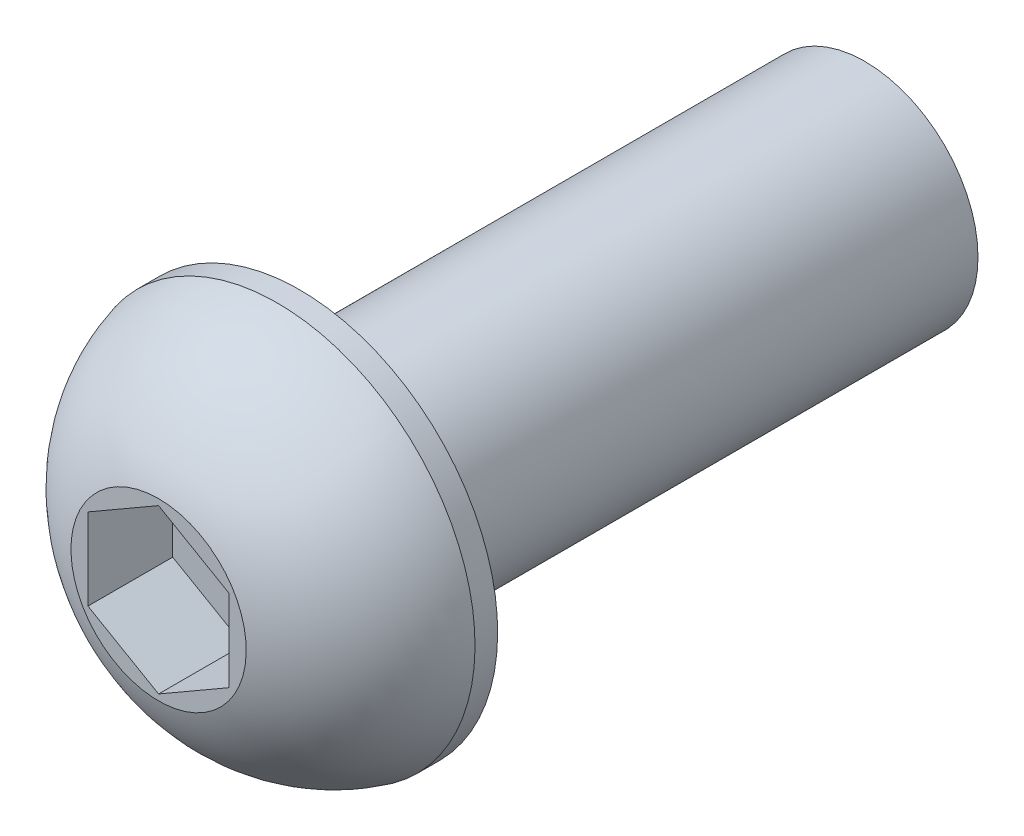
ISO-10303-21;
HEADER;
FILE_DESCRIPTION(('STEP AP214'),'2;1');
FILE_NAME('part.step','',(''),(''),'','','');
FILE_SCHEMA(('AUTOMOTIVE_DESIGN { 1 0 10303 214 1 1 1 1 }'));
ENDSEC;
DATA;
#1=APPLICATION_CONTEXT('core data for automotive mechanical design processes');
#2=APPLICATION_PROTOCOL_DEFINITION('international standard','automotive_design',2000,#1);
#3=PRODUCT_CONTEXT('',#1,'mechanical');
#4=PRODUCT('Part','Part','',(#3));
#5=PRODUCT_RELATED_PRODUCT_CATEGORY('part','',(#4));
#6=PRODUCT_DEFINITION_FORMATION('','',#4);
#7=PRODUCT_DEFINITION_CONTEXT('part definition',#1,'design');
#8=PRODUCT_DEFINITION('design','',#6,#7);
#9=PRODUCT_DEFINITION_SHAPE('','',#8);
#10=(LENGTH_UNIT() NAMED_UNIT(*) SI_UNIT(.MILLI.,.METRE.));
#11=(NAMED_UNIT(*) PLANE_ANGLE_UNIT() SI_UNIT($,.RADIAN.));
#12=(NAMED_UNIT(*) SI_UNIT($,.STERADIAN.) SOLID_ANGLE_UNIT());
#13=UNCERTAINTY_MEASURE_WITH_UNIT(LENGTH_MEASURE(1.E-05),#10,'distance_accuracy_value','');
#14=(GEOMETRIC_REPRESENTATION_CONTEXT(3) GLOBAL_UNCERTAINTY_ASSIGNED_CONTEXT((#13)) GLOBAL_UNIT_ASSIGNED_CONTEXT((#10,
#11,#12)) REPRESENTATION_CONTEXT('',''));
#15=CARTESIAN_POINT('',(0.,0.,0.));
#16=DIRECTION('',(0.,0.,1.));
#17=DIRECTION('',(1.,0.,0.));
#18=AXIS2_PLACEMENT_3D('',#15,#16,#17);
#19=CARTESIAN_POINT('',(0.,0.,5.));
#20=DIRECTION('',(0.,0.,1.));
#21=DIRECTION('',(0.86602540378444,-0.5,0.));
#22=AXIS2_PLACEMENT_3D('',#19,#20,#21);
#23=PLANE('',#22);
#24=CARTESIAN_POINT('',(0.,0.,5.));
#25=DIRECTION('',(0.,0.,1.));
#26=DIRECTION('',(0.86602540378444,-0.5,0.));
#27=AXIS2_PLACEMENT_3D('',#24,#25,#26);
#28=CIRCLE('',#27,3.10124400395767);
#29=CARTESIAN_POINT('',(2.68575609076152,-1.55062200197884,5.));
#30=VERTEX_POINT('',#29);
#31=EDGE_CURVE('E124',#30,#30,#28,.T.);
#32=ORIENTED_EDGE('',*,*,#31,.T.);
#33=EDGE_LOOP('',(#32));
#34=FACE_BOUND('',#33,.T.);
#35=DIRECTION('',(0.86602540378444,-0.5,0.));
#36=VECTOR('',#35,1.);
#37=CARTESIAN_POINT('',(0.,2.88675134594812,5.));
#38=LINE('',#37,#36);
#39=CARTESIAN_POINT('',(0.,2.88675134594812,5.));
#40=VERTEX_POINT('',#39);
#41=CARTESIAN_POINT('',(2.5,1.44337567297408,5.));
#42=VERTEX_POINT('',#41);
#43=EDGE_CURVE('E85',#40,#42,#38,.T.);
#44=ORIENTED_EDGE('',*,*,#43,.T.);
#45=DIRECTION('',(0.,-1.,0.));
#46=VECTOR('',#45,1.);
#47=CARTESIAN_POINT('',(2.5,1.44337567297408,5.));
#48=LINE('',#47,#46);
#49=CARTESIAN_POINT('',(2.5,-1.44337567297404,5.));
#50=VERTEX_POINT('',#49);
#51=EDGE_CURVE('E30',#42,#50,#48,.T.);
#52=ORIENTED_EDGE('',*,*,#51,.T.);
#53=DIRECTION('',(0.866025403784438,0.5,0.));
#54=VECTOR('',#53,1.);
#55=CARTESIAN_POINT('',(0.,-2.88675134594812,5.));
#56=LINE('',#55,#54);
#57=CARTESIAN_POINT('',(0.,-2.88675134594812,5.));
#58=VERTEX_POINT('',#57);
#59=EDGE_CURVE('E75',#58,#50,#56,.T.);
#60=ORIENTED_EDGE('',*,*,#59,.F.);
#61=DIRECTION('',(0.86602540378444,-0.5,0.));
#62=VECTOR('',#61,1.);
#63=CARTESIAN_POINT('',(-2.5,-1.44337567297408,5.));
#64=LINE('',#63,#62);
#65=CARTESIAN_POINT('',(-2.5,-1.44337567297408,5.));
#66=VERTEX_POINT('',#65);
#67=EDGE_CURVE('E80',#66,#58,#64,.T.);
#68=ORIENTED_EDGE('',*,*,#67,.F.);
#69=DIRECTION('',(0.,1.,0.));
#70=VECTOR('',#69,1.);
#71=CARTESIAN_POINT('',(-2.5,-1.44337567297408,5.));
#72=LINE('',#71,#70);
#73=CARTESIAN_POINT('',(-2.5,1.44337567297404,5.));
#74=VERTEX_POINT('',#73);
#75=EDGE_CURVE('E92',#66,#74,#72,.T.);
#76=ORIENTED_EDGE('',*,*,#75,.T.);
#77=DIRECTION('',(-0.866025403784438,-0.5,0.));
#78=VECTOR('',#77,1.);
#79=CARTESIAN_POINT('',(0.,2.88675134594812,5.));
#80=LINE('',#79,#78);
#81=EDGE_CURVE('E95',#40,#74,#80,.T.);
#82=ORIENTED_EDGE('',*,*,#81,.F.);
#83=EDGE_LOOP('',(#44,#52,#60,#68,#76,#82));
#84=FACE_BOUND('',#83,.T.);
#85=ADVANCED_FACE('F15',(#34,#84),#23,.T.);
#86=CARTESIAN_POINT('',(2.00000000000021,3.46410161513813,0.));
#87=DIRECTION('',(0.,0.,1.));
#88=DIRECTION('',(0.86602540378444,-0.5,0.));
#89=AXIS2_PLACEMENT_3D('',#86,#87,#88);
#90=PLANE('',#89);
#91=CARTESIAN_POINT('',(0.,0.,0.));
#92=DIRECTION('',(0.,0.,1.));
#93=DIRECTION('',(0.86602540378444,-0.5,0.));
#94=AXIS2_PLACEMENT_3D('',#91,#92,#93);
#95=CIRCLE('',#94,7.00000000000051);
#96=CARTESIAN_POINT('',(6.06217782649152,-3.50000000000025,0.));
#97=VERTEX_POINT('',#96);
#98=EDGE_CURVE('E9',#97,#97,#95,.T.);
#99=ORIENTED_EDGE('',*,*,#98,.F.);
#100=EDGE_LOOP('',(#99));
#101=FACE_BOUND('',#100,.T.);
#102=CARTESIAN_POINT('',(0.,0.,0.));
#103=DIRECTION('',(0.,0.,1.));
#104=DIRECTION('',(0.86602540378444,-0.5,0.));
#105=AXIS2_PLACEMENT_3D('',#102,#103,#104);
#106=CIRCLE('',#105,4.00000000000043);
#107=CARTESIAN_POINT('',(3.46410161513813,-2.00000000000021,0.));
#108=VERTEX_POINT('',#107);
#109=EDGE_CURVE('E71',#108,#108,#106,.T.);
#110=ORIENTED_EDGE('',*,*,#109,.T.);
#111=EDGE_LOOP('',(#110));
#112=FACE_BOUND('',#111,.T.);
#113=ADVANCED_FACE('F17',(#101,#112),#90,.F.);
#114=CARTESIAN_POINT('',(0.,0.,20.));
#115=DIRECTION('',(0.,0.,1.));
#116=DIRECTION('',(0.86602540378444,-0.5,0.));
#117=AXIS2_PLACEMENT_3D('',#114,#115,#116);
#118=CYLINDRICAL_SURFACE('',#117,7.00000000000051);
#119=ORIENTED_EDGE('',*,*,#98,.T.);
#120=EDGE_LOOP('',(#119));
#121=FACE_BOUND('',#120,.T.);
#122=CARTESIAN_POINT('',(0.,0.,0.8));
#123=DIRECTION('',(0.,0.,1.));
#124=DIRECTION('',(0.86602540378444,-0.5,0.));
#125=AXIS2_PLACEMENT_3D('',#122,#123,#124);
#126=CIRCLE('',#125,7.00000000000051);
#127=CARTESIAN_POINT('',(6.06217782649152,-3.50000000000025,0.8));
#128=VERTEX_POINT('',#127);
#129=EDGE_CURVE('E23',#128,#128,#126,.T.);
#130=ORIENTED_EDGE('',*,*,#129,.F.);
#131=EDGE_LOOP('',(#130));
#132=FACE_BOUND('',#131,.T.);
#133=ADVANCED_FACE('F131',(#121,#132),#118,.T.);
#134=CARTESIAN_POINT('',(0.,0.,-0.686461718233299));
#135=DIRECTION('',(0.,0.,1.));
#136=DIRECTION('',(0.86602540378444,-0.5,0.));
#137=AXIS2_PLACEMENT_3D('',#134,#135,#136);
#138=DEGENERATE_TOROIDAL_SURFACE('',#137,1.18704622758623,5.99999999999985,.T.);
#139=ORIENTED_EDGE('',*,*,#31,.F.);
#140=EDGE_LOOP('',(#139));
#141=FACE_BOUND('',#140,.T.);
#142=ORIENTED_EDGE('',*,*,#129,.T.);
#143=EDGE_LOOP('',(#142));
#144=FACE_BOUND('',#143,.T.);
#145=ADVANCED_FACE('F129',(#141,#144),#138,.T.);
#146=CARTESIAN_POINT('',(0.,0.,20.));
#147=DIRECTION('',(0.,0.,1.));
#148=DIRECTION('',(0.86602540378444,-0.5,0.));
#149=AXIS2_PLACEMENT_3D('',#146,#147,#148);
#150=CYLINDRICAL_SURFACE('',#149,4.00000000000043);
#151=ORIENTED_EDGE('',*,*,#109,.F.);
#152=EDGE_LOOP('',(#151));
#153=FACE_BOUND('',#152,.T.);
#154=CARTESIAN_POINT('',(0.,0.,-20.));
#155=DIRECTION('',(0.,0.,1.));
#156=DIRECTION('',(1.,0.,0.));
#157=AXIS2_PLACEMENT_3D('',#154,#155,#156);
#158=CIRCLE('',#157,4.00000000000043);
#159=CARTESIAN_POINT('',(4.00000000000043,0.,-20.));
#160=VERTEX_POINT('',#159);
#161=EDGE_CURVE('E86',#160,#160,#158,.T.);
#162=ORIENTED_EDGE('',*,*,#161,.T.);
#163=EDGE_LOOP('',(#162));
#164=FACE_BOUND('',#163,.T.);
#165=ADVANCED_FACE('F140',(#153,#164),#150,.T.);
#166=CARTESIAN_POINT('',(2.5,1.44337567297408,2.));
#167=DIRECTION('',(-1.,0.,0.));
#168=DIRECTION('',(0.,-1.,0.));
#169=AXIS2_PLACEMENT_3D('',#166,#167,#168);
#170=PLANE('',#169);
#171=DIRECTION('',(0.,0.,1.));
#172=VECTOR('',#171,1.);
#173=CARTESIAN_POINT('',(2.5,-1.44337567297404,2.));
#174=LINE('',#173,#172);
#175=CARTESIAN_POINT('',(2.5,-1.44337567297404,2.));
#176=VERTEX_POINT('',#175);
#177=EDGE_CURVE('E64',#176,#50,#174,.T.);
#178=ORIENTED_EDGE('',*,*,#177,.T.);
#179=ORIENTED_EDGE('',*,*,#51,.F.);
#180=DIRECTION('',(0.,0.,1.));
#181=VECTOR('',#180,1.);
#182=CARTESIAN_POINT('',(2.5,1.44337567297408,2.));
#183=LINE('',#182,#181);
#184=CARTESIAN_POINT('',(2.5,1.44337567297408,2.));
#185=VERTEX_POINT('',#184);
#186=EDGE_CURVE('E34',#185,#42,#183,.T.);
#187=ORIENTED_EDGE('',*,*,#186,.F.);
#188=DIRECTION('',(0.,-1.,0.));
#189=VECTOR('',#188,1.);
#190=CARTESIAN_POINT('',(2.5,1.44337567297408,2.));
#191=LINE('',#190,#189);
#192=EDGE_CURVE('E67',#185,#176,#191,.T.);
#193=ORIENTED_EDGE('',*,*,#192,.T.);
#194=EDGE_LOOP('',(#178,#179,#187,#193));
#195=FACE_BOUND('',#194,.T.);
#196=ADVANCED_FACE('F66',(#195),#170,.T.);
#197=CARTESIAN_POINT('',(0.,-2.88675134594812,2.));
#198=DIRECTION('',(0.5,-0.866025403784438,0.));
#199=DIRECTION('',(0.866025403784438,0.5,0.));
#200=AXIS2_PLACEMENT_3D('',#197,#198,#199);
#201=PLANE('',#200);
#202=DIRECTION('',(0.,0.,1.));
#203=VECTOR('',#202,1.);
#204=CARTESIAN_POINT('',(0.,-2.88675134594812,2.));
#205=LINE('',#204,#203);
#206=CARTESIAN_POINT('',(0.,-2.88675134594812,2.));
#207=VERTEX_POINT('',#206);
#208=EDGE_CURVE('E72',#207,#58,#205,.T.);
#209=ORIENTED_EDGE('',*,*,#208,.T.);
#210=ORIENTED_EDGE('',*,*,#59,.T.);
#211=ORIENTED_EDGE('',*,*,#177,.F.);
#212=DIRECTION('',(0.866025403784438,0.5,0.));
#213=VECTOR('',#212,1.);
#214=CARTESIAN_POINT('',(0.,-2.88675134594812,2.));
#215=LINE('',#214,#213);
#216=EDGE_CURVE('E100',#207,#176,#215,.T.);
#217=ORIENTED_EDGE('',*,*,#216,.F.);
#218=EDGE_LOOP('',(#209,#210,#211,#217));
#219=FACE_BOUND('',#218,.T.);
#220=ADVANCED_FACE('F76',(#219),#201,.F.);
#221=CARTESIAN_POINT('',(-2.5,-1.44337567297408,2.));
#222=DIRECTION('',(-0.5,-0.86602540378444,0.));
#223=DIRECTION('',(0.86602540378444,-0.5,0.));
#224=AXIS2_PLACEMENT_3D('',#221,#222,#223);
#225=PLANE('',#224);
#226=DIRECTION('',(0.,0.,1.));
#227=VECTOR('',#226,1.);
#228=CARTESIAN_POINT('',(-2.5,-1.44337567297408,2.));
#229=LINE('',#228,#227);
#230=CARTESIAN_POINT('',(-2.5,-1.44337567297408,2.));
#231=VERTEX_POINT('',#230);
#232=EDGE_CURVE('E119',#231,#66,#229,.T.);
#233=ORIENTED_EDGE('',*,*,#232,.T.);
#234=ORIENTED_EDGE('',*,*,#67,.T.);
#235=ORIENTED_EDGE('',*,*,#208,.F.);
#236=DIRECTION('',(0.86602540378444,-0.5,0.));
#237=VECTOR('',#236,1.);
#238=CARTESIAN_POINT('',(-2.5,-1.44337567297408,2.));
#239=LINE('',#238,#237);
#240=EDGE_CURVE('E102',#231,#207,#239,.T.);
#241=ORIENTED_EDGE('',*,*,#240,.F.);
#242=EDGE_LOOP('',(#233,#234,#235,#241));
#243=FACE_BOUND('',#242,.T.);
#244=ADVANCED_FACE('F162',(#243),#225,.F.);
#245=CARTESIAN_POINT('',(-2.5,-1.44337567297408,2.));
#246=DIRECTION('',(1.,0.,0.));
#247=DIRECTION('',(0.,1.,0.));
#248=AXIS2_PLACEMENT_3D('',#245,#246,#247);
#249=PLANE('',#248);
#250=DIRECTION('',(0.,0.,1.));
#251=VECTOR('',#250,1.);
#252=CARTESIAN_POINT('',(-2.5,1.44337567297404,2.));
#253=LINE('',#252,#251);
#254=CARTESIAN_POINT('',(-2.5,1.44337567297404,2.));
#255=VERTEX_POINT('',#254);
#256=EDGE_CURVE('E117',#255,#74,#253,.T.);
#257=ORIENTED_EDGE('',*,*,#256,.T.);
#258=ORIENTED_EDGE('',*,*,#75,.F.);
#259=ORIENTED_EDGE('',*,*,#232,.F.);
#260=DIRECTION('',(0.,1.,0.));
#261=VECTOR('',#260,1.);
#262=CARTESIAN_POINT('',(-2.5,-1.44337567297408,2.));
#263=LINE('',#262,#261);
#264=EDGE_CURVE('E105',#231,#255,#263,.T.);
#265=ORIENTED_EDGE('',*,*,#264,.T.);
#266=EDGE_LOOP('',(#257,#258,#259,#265));
#267=FACE_BOUND('',#266,.T.);
#268=ADVANCED_FACE('F165',(#267),#249,.T.);
#269=CARTESIAN_POINT('',(0.,2.88675134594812,2.));
#270=DIRECTION('',(-0.5,0.866025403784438,0.));
#271=DIRECTION('',(-0.866025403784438,-0.5,0.));
#272=AXIS2_PLACEMENT_3D('',#269,#270,#271);
#273=PLANE('',#272);
#274=DIRECTION('',(0.,0.,1.));
#275=VECTOR('',#274,1.);
#276=CARTESIAN_POINT('',(0.,2.88675134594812,2.));
#277=LINE('',#276,#275);
#278=CARTESIAN_POINT('',(0.,2.88675134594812,2.));
#279=VERTEX_POINT('',#278);
#280=EDGE_CURVE('E115',#279,#40,#277,.T.);
#281=ORIENTED_EDGE('',*,*,#280,.T.);
#282=ORIENTED_EDGE('',*,*,#81,.T.);
#283=ORIENTED_EDGE('',*,*,#256,.F.);
#284=DIRECTION('',(-0.866025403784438,-0.5,0.));
#285=VECTOR('',#284,1.);
#286=CARTESIAN_POINT('',(0.,2.88675134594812,2.));
#287=LINE('',#286,#285);
#288=EDGE_CURVE('E108',#279,#255,#287,.T.);
#289=ORIENTED_EDGE('',*,*,#288,.F.);
#290=EDGE_LOOP('',(#281,#282,#283,#289));
#291=FACE_BOUND('',#290,.T.);
#292=ADVANCED_FACE('F169',(#291),#273,.F.);
#293=CARTESIAN_POINT('',(0.,2.88675134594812,2.));
#294=DIRECTION('',(-0.5,-0.86602540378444,0.));
#295=DIRECTION('',(0.86602540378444,-0.5,0.));
#296=AXIS2_PLACEMENT_3D('',#293,#294,#295);
#297=PLANE('',#296);
#298=DIRECTION('',(0.86602540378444,-0.5,0.));
#299=VECTOR('',#298,1.);
#300=CARTESIAN_POINT('',(0.,2.88675134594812,2.));
#301=LINE('',#300,#299);
#302=EDGE_CURVE('E111',#279,#185,#301,.T.);
#303=ORIENTED_EDGE('',*,*,#302,.T.);
#304=ORIENTED_EDGE('',*,*,#186,.T.);
#305=ORIENTED_EDGE('',*,*,#43,.F.);
#306=ORIENTED_EDGE('',*,*,#280,.F.);
#307=EDGE_LOOP('',(#303,#304,#305,#306));
#308=FACE_BOUND('',#307,.T.);
#309=ADVANCED_FACE('F156',(#308),#297,.T.);
#310=CARTESIAN_POINT('',(2.5,-4.33012701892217,2.));
#311=DIRECTION('',(0.,0.,1.));
#312=DIRECTION('',(0.86602540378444,-0.5,0.));
#313=AXIS2_PLACEMENT_3D('',#310,#311,#312);
#314=PLANE('',#313);
#315=ORIENTED_EDGE('',*,*,#192,.F.);
#316=ORIENTED_EDGE('',*,*,#302,.F.);
#317=ORIENTED_EDGE('',*,*,#288,.T.);
#318=ORIENTED_EDGE('',*,*,#264,.F.);
#319=ORIENTED_EDGE('',*,*,#240,.T.);
#320=ORIENTED_EDGE('',*,*,#216,.T.);
#321=EDGE_LOOP('',(#315,#316,#317,#318,#319,#320));
#322=FACE_BOUND('',#321,.T.);
#323=ADVANCED_FACE('F154',(#322),#314,.T.);
#324=CARTESIAN_POINT('',(1.4000000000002,2.42487113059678,-20.));
#325=DIRECTION('',(0.,0.,-1.));
#326=DIRECTION('',(-0.86602540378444,0.5,0.));
#327=AXIS2_PLACEMENT_3D('',#324,#325,#326);
#328=PLANE('',#327);
#329=ORIENTED_EDGE('',*,*,#161,.F.);
#330=EDGE_LOOP('',(#329));
#331=FACE_BOUND('',#330,.T.);
#332=ADVANCED_FACE('F151',(#331),#328,.T.);
#333=CLOSED_SHELL('',(#85,#113,#133,#145,#165,#196,#220,#244,#268,#292,#309,#323,#332));
#334=MANIFOLD_SOLID_BREP('B1',#333);
#335=ADVANCED_BREP_SHAPE_REPRESENTATION('',(#18,#334),#14);
#336=SHAPE_DEFINITION_REPRESENTATION(#9,#335);
ENDSEC;
END-ISO-10303-21;
